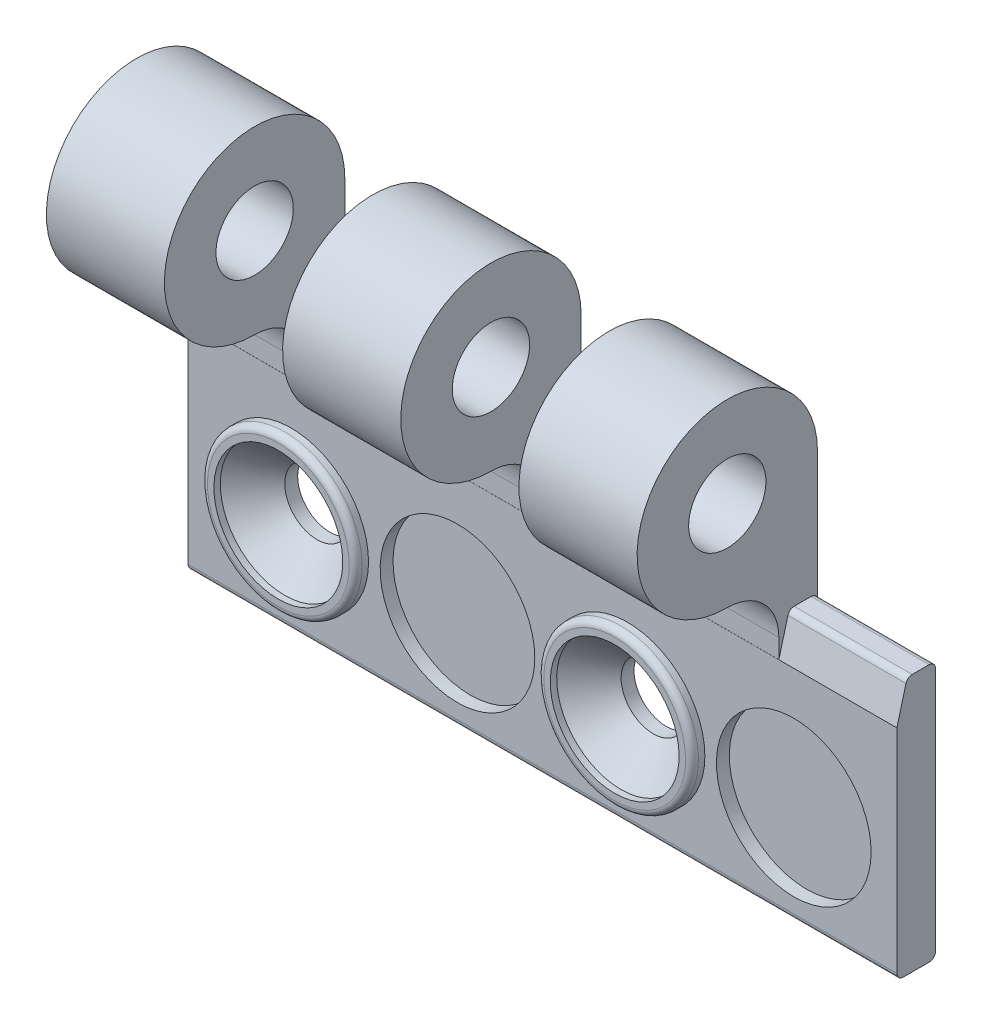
ISO-10303-21;
HEADER;
FILE_DESCRIPTION(('STEP AP214'),'2;1');
FILE_NAME('part.step','',(''),(''),'','','');
FILE_SCHEMA(('AUTOMOTIVE_DESIGN { 1 0 10303 214 1 1 1 1 }'));
ENDSEC;
DATA;
#1=APPLICATION_CONTEXT('core data for automotive mechanical design processes');
#2=APPLICATION_PROTOCOL_DEFINITION('international standard','automotive_design',2000,#1);
#3=PRODUCT_CONTEXT('',#1,'mechanical');
#4=PRODUCT('Part','Part','',(#3));
#5=PRODUCT_RELATED_PRODUCT_CATEGORY('part','',(#4));
#6=PRODUCT_DEFINITION_FORMATION('','',#4);
#7=PRODUCT_DEFINITION_CONTEXT('part definition',#1,'design');
#8=PRODUCT_DEFINITION('design','',#6,#7);
#9=PRODUCT_DEFINITION_SHAPE('','',#8);
#10=(LENGTH_UNIT() NAMED_UNIT(*) SI_UNIT(.MILLI.,.METRE.));
#11=(NAMED_UNIT(*) PLANE_ANGLE_UNIT() SI_UNIT($,.RADIAN.));
#12=(NAMED_UNIT(*) SI_UNIT($,.STERADIAN.) SOLID_ANGLE_UNIT());
#13=UNCERTAINTY_MEASURE_WITH_UNIT(LENGTH_MEASURE(1.E-05),#10,'distance_accuracy_value','');
#14=(GEOMETRIC_REPRESENTATION_CONTEXT(3) GLOBAL_UNCERTAINTY_ASSIGNED_CONTEXT((#13)) GLOBAL_UNIT_ASSIGNED_CONTEXT((#10,
#11,#12)) REPRESENTATION_CONTEXT('',''));
#15=CARTESIAN_POINT('',(0.,0.,0.));
#16=DIRECTION('',(0.,0.,1.));
#17=DIRECTION('',(1.,0.,0.));
#18=AXIS2_PLACEMENT_3D('',#15,#16,#17);
#19=CARTESIAN_POINT('',(-8.,11.85,0.49999999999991));
#20=DIRECTION('',(1.,0.,0.));
#21=DIRECTION('',(0.,1.,0.));
#22=AXIS2_PLACEMENT_3D('',#19,#20,#21);
#23=CYLINDRICAL_SURFACE('',#22,0.49999999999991);
#24=DIRECTION('',(1.,0.,0.));
#25=VECTOR('',#24,1.);
#26=CARTESIAN_POINT('',(-8.,11.8632012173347,0.000174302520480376));
#27=LINE('',#26,#25);
#28=CARTESIAN_POINT('',(1.16,11.8632012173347,0.000174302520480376));
#29=VERTEX_POINT('',#28);
#30=CARTESIAN_POINT('',(-8.,11.8632012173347,0.000174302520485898));
#31=VERTEX_POINT('',#30);
#32=EDGE_CURVE('E228',#29,#31,#27,.F.);
#33=ORIENTED_EDGE('',*,*,#32,.F.);
#34=CARTESIAN_POINT('',(1.16,11.85,0.49999999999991));
#35=DIRECTION('',(1.,0.,0.));
#36=DIRECTION('',(0.,1.,0.));
#37=AXIS2_PLACEMENT_3D('',#34,#35,#36);
#38=CIRCLE('',#37,0.49999999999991);
#39=CARTESIAN_POINT('',(1.16,12.35,0.5));
#40=VERTEX_POINT('',#39);
#41=EDGE_CURVE('E249',#40,#29,#38,.F.);
#42=ORIENTED_EDGE('',*,*,#41,.F.);
#43=DIRECTION('',(1.,0.,0.));
#44=VECTOR('',#43,1.);
#45=CARTESIAN_POINT('',(-8.,12.35,0.5));
#46=LINE('',#45,#44);
#47=CARTESIAN_POINT('',(10.33,12.35,0.5));
#48=VERTEX_POINT('',#47);
#49=EDGE_CURVE('E464',#40,#48,#46,.T.);
#50=ORIENTED_EDGE('',*,*,#49,.T.);
#51=CARTESIAN_POINT('',(10.33,11.85,0.49999999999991));
#52=DIRECTION('',(1.,0.,0.));
#53=DIRECTION('',(0.,1.,0.));
#54=AXIS2_PLACEMENT_3D('',#51,#52,#53);
#55=CIRCLE('',#54,0.49999999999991);
#56=CARTESIAN_POINT('',(10.33,11.8632012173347,0.000174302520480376));
#57=VERTEX_POINT('',#56);
#58=EDGE_CURVE('E359',#48,#57,#55,.F.);
#59=ORIENTED_EDGE('',*,*,#58,.T.);
#60=DIRECTION('',(1.,0.,0.));
#61=VECTOR('',#60,1.);
#62=CARTESIAN_POINT('',(-8.,11.8632012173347,0.000174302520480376));
#63=LINE('',#62,#61);
#64=CARTESIAN_POINT('',(19.5,11.8632012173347,0.000174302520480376));
#65=VERTEX_POINT('',#64);
#66=EDGE_CURVE('E494',#65,#57,#63,.F.);
#67=ORIENTED_EDGE('',*,*,#66,.F.);
#68=CARTESIAN_POINT('',(19.5,11.85,0.49999999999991));
#69=DIRECTION('',(1.,0.,0.));
#70=DIRECTION('',(0.,1.,0.));
#71=AXIS2_PLACEMENT_3D('',#68,#69,#70);
#72=CIRCLE('',#71,0.49999999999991);
#73=CARTESIAN_POINT('',(19.5,12.35,0.5));
#74=VERTEX_POINT('',#73);
#75=EDGE_CURVE('E350',#74,#65,#72,.F.);
#76=ORIENTED_EDGE('',*,*,#75,.F.);
#77=CARTESIAN_POINT('',(28.67,12.35,0.5));
#78=VERTEX_POINT('',#77);
#79=EDGE_CURVE('E467',#74,#78,#46,.T.);
#80=ORIENTED_EDGE('',*,*,#79,.T.);
#81=CARTESIAN_POINT('',(28.67,11.85,0.49999999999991));
#82=DIRECTION('',(1.,0.,0.));
#83=DIRECTION('',(0.,1.,0.));
#84=AXIS2_PLACEMENT_3D('',#81,#82,#83);
#85=CIRCLE('',#84,0.49999999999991);
#86=CARTESIAN_POINT('',(28.67,11.8632012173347,0.000174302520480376));
#87=VERTEX_POINT('',#86);
#88=EDGE_CURVE('E31',#78,#87,#85,.F.);
#89=ORIENTED_EDGE('',*,*,#88,.T.);
#90=DIRECTION('',(1.,0.,0.));
#91=VECTOR('',#90,1.);
#92=CARTESIAN_POINT('',(-8.,11.8632012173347,0.000174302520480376));
#93=LINE('',#92,#91);
#94=CARTESIAN_POINT('',(37.84,11.8632012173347,0.000174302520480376));
#95=VERTEX_POINT('',#94);
#96=EDGE_CURVE('E24',#95,#87,#93,.F.);
#97=ORIENTED_EDGE('',*,*,#96,.F.);
#98=CARTESIAN_POINT('',(37.84,11.85,0.49999999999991));
#99=DIRECTION('',(1.,0.,0.));
#100=DIRECTION('',(0.,1.,0.));
#101=AXIS2_PLACEMENT_3D('',#98,#99,#100);
#102=CIRCLE('',#101,0.49999999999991);
#103=CARTESIAN_POINT('',(37.84,12.35,0.5));
#104=VERTEX_POINT('',#103);
#105=EDGE_CURVE('E297',#104,#95,#102,.F.);
#106=ORIENTED_EDGE('',*,*,#105,.F.);
#107=CARTESIAN_POINT('',(47.,12.35,0.5));
#108=VERTEX_POINT('',#107);
#109=EDGE_CURVE('E462',#104,#108,#46,.T.);
#110=ORIENTED_EDGE('',*,*,#109,.T.);
#111=CARTESIAN_POINT('',(47.,11.85,0.49999999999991));
#112=DIRECTION('',(1.,0.,0.));
#113=DIRECTION('',(0.,-1.,0.));
#114=AXIS2_PLACEMENT_3D('',#111,#112,#113);
#115=CIRCLE('',#114,0.49999999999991);
#116=CARTESIAN_POINT('',(47.,11.85,0.));
#117=VERTEX_POINT('',#116);
#118=EDGE_CURVE('E410',#117,#108,#115,.T.);
#119=ORIENTED_EDGE('',*,*,#118,.F.);
#120=DIRECTION('',(1.,0.,0.));
#121=VECTOR('',#120,1.);
#122=CARTESIAN_POINT('',(-8.,11.85,0.));
#123=LINE('',#122,#121);
#124=CARTESIAN_POINT('',(-8.,11.85,0.));
#125=VERTEX_POINT('',#124);
#126=EDGE_CURVE('E466',#125,#117,#123,.T.);
#127=ORIENTED_EDGE('',*,*,#126,.F.);
#128=CARTESIAN_POINT('',(-8.,11.85,0.49999999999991));
#129=DIRECTION('',(1.,0.,0.));
#130=DIRECTION('',(0.,-1.,0.));
#131=AXIS2_PLACEMENT_3D('',#128,#129,#130);
#132=CIRCLE('',#131,0.49999999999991);
#133=EDGE_CURVE('E437',#125,#31,#132,.T.);
#134=ORIENTED_EDGE('',*,*,#133,.T.);
#135=EDGE_LOOP('',(#33,#42,#50,#59,#67,#76,#80,#89,#97,#106,#110,#119,#127,#134));
#136=FACE_BOUND('',#135,.T.);
#137=ADVANCED_FACE('F16',(#136),#23,.T.);
#138=CARTESIAN_POINT('',(-8.,11.9794095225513,2.2954518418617));
#139=DIRECTION('',(0.,0.258819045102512,0.965925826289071));
#140=DIRECTION('',(0.,-0.965925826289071,0.258819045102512));
#141=AXIS2_PLACEMENT_3D('',#138,#139,#140);
#142=PLANE('',#141);
#143=DIRECTION('',(1.,0.,0.));
#144=VECTOR('',#143,1.);
#145=CARTESIAN_POINT('',(-8.,9.35373205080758,2.999));
#146=LINE('',#145,#144);
#147=CARTESIAN_POINT('',(-8.,9.35373205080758,2.999));
#148=VERTEX_POINT('',#147);
#149=CARTESIAN_POINT('',(1.16,9.35373205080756,2.999));
#150=VERTEX_POINT('',#149);
#151=EDGE_CURVE('E236',#148,#150,#146,.T.);
#152=ORIENTED_EDGE('',*,*,#151,.F.);
#153=DIRECTION('',(0.,-0.965925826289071,0.258819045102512));
#154=VECTOR('',#153,1.);
#155=CARTESIAN_POINT('',(-8.,11.9794095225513,2.2954518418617));
#156=LINE('',#155,#154);
#157=CARTESIAN_POINT('',(-8.,9.35,3.));
#158=VERTEX_POINT('',#157);
#159=EDGE_CURVE('E439',#148,#158,#156,.T.);
#160=ORIENTED_EDGE('',*,*,#159,.T.);
#161=DIRECTION('',(1.,0.,0.));
#162=VECTOR('',#161,1.);
#163=CARTESIAN_POINT('',(-8.,9.35,3.));
#164=LINE('',#163,#162);
#165=CARTESIAN_POINT('',(47.,9.35,3.));
#166=VERTEX_POINT('',#165);
#167=EDGE_CURVE('E453',#158,#166,#164,.T.);
#168=ORIENTED_EDGE('',*,*,#167,.T.);
#169=DIRECTION('',(0.,-0.965925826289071,0.258819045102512));
#170=VECTOR('',#169,1.);
#171=CARTESIAN_POINT('',(47.,11.9794095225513,2.2954518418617));
#172=LINE('',#171,#170);
#173=CARTESIAN_POINT('',(47.,11.9794095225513,2.2954518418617));
#174=VERTEX_POINT('',#173);
#175=EDGE_CURVE('E419',#174,#166,#172,.T.);
#176=ORIENTED_EDGE('',*,*,#175,.F.);
#177=DIRECTION('',(1.,0.,0.));
#178=VECTOR('',#177,1.);
#179=CARTESIAN_POINT('',(-8.,11.9794095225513,2.2954518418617));
#180=LINE('',#179,#178);
#181=CARTESIAN_POINT('',(37.84,11.9794095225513,2.2954518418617));
#182=VERTEX_POINT('',#181);
#183=EDGE_CURVE('E455',#182,#174,#180,.T.);
#184=ORIENTED_EDGE('',*,*,#183,.F.);
#185=DIRECTION('',(0.,0.965925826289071,-0.258819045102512));
#186=VECTOR('',#185,1.);
#187=CARTESIAN_POINT('',(37.84,11.9794095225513,2.2954518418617));
#188=LINE('',#187,#186);
#189=CARTESIAN_POINT('',(37.84,9.35373205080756,2.999));
#190=VERTEX_POINT('',#189);
#191=EDGE_CURVE('E294',#190,#182,#188,.T.);
#192=ORIENTED_EDGE('',*,*,#191,.F.);
#193=DIRECTION('',(1.,0.,0.));
#194=VECTOR('',#193,1.);
#195=CARTESIAN_POINT('',(-8.,9.35373205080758,2.999));
#196=LINE('',#195,#194);
#197=CARTESIAN_POINT('',(28.67,9.35373205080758,2.999));
#198=VERTEX_POINT('',#197);
#199=EDGE_CURVE('E502',#198,#190,#196,.T.);
#200=ORIENTED_EDGE('',*,*,#199,.F.);
#201=DIRECTION('',(0.,0.965925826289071,-0.258819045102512));
#202=VECTOR('',#201,1.);
#203=CARTESIAN_POINT('',(28.67,11.9794095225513,2.2954518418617));
#204=LINE('',#203,#202);
#205=CARTESIAN_POINT('',(28.67,11.9794095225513,2.2954518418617));
#206=VERTEX_POINT('',#205);
#207=EDGE_CURVE('E301',#198,#206,#204,.T.);
#208=ORIENTED_EDGE('',*,*,#207,.T.);
#209=CARTESIAN_POINT('',(19.5,11.9794095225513,2.2954518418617));
#210=VERTEX_POINT('',#209);
#211=EDGE_CURVE('E459',#210,#206,#180,.T.);
#212=ORIENTED_EDGE('',*,*,#211,.F.);
#213=DIRECTION('',(0.,0.965925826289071,-0.258819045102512));
#214=VECTOR('',#213,1.);
#215=CARTESIAN_POINT('',(19.5,11.9794095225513,2.2954518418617));
#216=LINE('',#215,#214);
#217=CARTESIAN_POINT('',(19.5,9.35373205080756,2.999));
#218=VERTEX_POINT('',#217);
#219=EDGE_CURVE('E485',#218,#210,#216,.T.);
#220=ORIENTED_EDGE('',*,*,#219,.F.);
#221=DIRECTION('',(1.,0.,0.));
#222=VECTOR('',#221,1.);
#223=CARTESIAN_POINT('',(-8.,9.35373205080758,2.999));
#224=LINE('',#223,#222);
#225=CARTESIAN_POINT('',(10.33,9.35373205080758,2.999));
#226=VERTEX_POINT('',#225);
#227=EDGE_CURVE('E488',#226,#218,#224,.T.);
#228=ORIENTED_EDGE('',*,*,#227,.F.);
#229=DIRECTION('',(0.,0.965925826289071,-0.258819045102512));
#230=VECTOR('',#229,1.);
#231=CARTESIAN_POINT('',(10.33,11.9794095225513,2.2954518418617));
#232=LINE('',#231,#230);
#233=CARTESIAN_POINT('',(10.33,11.9794095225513,2.2954518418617));
#234=VERTEX_POINT('',#233);
#235=EDGE_CURVE('E491',#226,#234,#232,.T.);
#236=ORIENTED_EDGE('',*,*,#235,.T.);
#237=CARTESIAN_POINT('',(1.16,11.9794095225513,2.2954518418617));
#238=VERTEX_POINT('',#237);
#239=EDGE_CURVE('E456',#238,#234,#180,.T.);
#240=ORIENTED_EDGE('',*,*,#239,.F.);
#241=DIRECTION('',(0.,0.965925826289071,-0.258819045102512));
#242=VECTOR('',#241,1.);
#243=CARTESIAN_POINT('',(1.16,11.9794095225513,2.2954518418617));
#244=LINE('',#243,#242);
#245=EDGE_CURVE('E247',#150,#238,#244,.T.);
#246=ORIENTED_EDGE('',*,*,#245,.F.);
#247=EDGE_LOOP('',(#152,#160,#168,#176,#184,#192,#200,#208,#212,#220,#228,#236,#240,#246));
#248=FACE_BOUND('',#247,.T.);
#249=ADVANCED_FACE('F550',(#248),#142,.T.);
#250=CARTESIAN_POINT('',(-8.,12.35,0.5));
#251=DIRECTION('',(0.,1.,0.));
#252=DIRECTION('',(-1.,0.,0.));
#253=AXIS2_PLACEMENT_3D('',#250,#251,#252);
#254=PLANE('',#253);
#255=DIRECTION('',(1.,0.,0.));
#256=VECTOR('',#255,1.);
#257=CARTESIAN_POINT('',(-8.,12.35,1.8124889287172));
#258=LINE('',#257,#256);
#259=CARTESIAN_POINT('',(19.5,12.35,1.8124889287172));
#260=VERTEX_POINT('',#259);
#261=CARTESIAN_POINT('',(28.67,12.35,1.8124889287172));
#262=VERTEX_POINT('',#261);
#263=EDGE_CURVE('E463',#260,#262,#258,.T.);
#264=ORIENTED_EDGE('',*,*,#263,.T.);
#265=DIRECTION('',(0.,0.,-1.));
#266=VECTOR('',#265,1.);
#267=CARTESIAN_POINT('',(28.67,12.35,0.5));
#268=LINE('',#267,#266);
#269=EDGE_CURVE('E299',#262,#78,#268,.T.);
#270=ORIENTED_EDGE('',*,*,#269,.T.);
#271=ORIENTED_EDGE('',*,*,#79,.F.);
#272=DIRECTION('',(0.,0.,-1.));
#273=VECTOR('',#272,1.);
#274=CARTESIAN_POINT('',(19.5,12.35,0.5));
#275=LINE('',#274,#273);
#276=EDGE_CURVE('E347',#260,#74,#275,.T.);
#277=ORIENTED_EDGE('',*,*,#276,.F.);
#278=EDGE_LOOP('',(#264,#270,#271,#277));
#279=FACE_BOUND('',#278,.T.);
#280=ADVANCED_FACE('F531',(#279),#254,.T.);
#281=CARTESIAN_POINT('',(-8.,11.8499999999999,1.81248892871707));
#282=DIRECTION('',(1.,0.,0.));
#283=DIRECTION('',(0.,1.,0.));
#284=AXIS2_PLACEMENT_3D('',#281,#282,#283);
#285=CYLINDRICAL_SURFACE('',#284,0.500000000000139);
#286=ORIENTED_EDGE('',*,*,#211,.T.);
#287=CARTESIAN_POINT('',(28.67,11.8499999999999,1.81248892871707));
#288=DIRECTION('',(1.,0.,0.));
#289=DIRECTION('',(0.,1.,0.));
#290=AXIS2_PLACEMENT_3D('',#287,#288,#289);
#291=CIRCLE('',#290,0.500000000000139);
#292=EDGE_CURVE('E500',#206,#262,#291,.F.);
#293=ORIENTED_EDGE('',*,*,#292,.T.);
#294=ORIENTED_EDGE('',*,*,#263,.F.);
#295=CARTESIAN_POINT('',(19.5,11.8499999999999,1.81248892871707));
#296=DIRECTION('',(1.,0.,0.));
#297=DIRECTION('',(0.,1.,0.));
#298=AXIS2_PLACEMENT_3D('',#295,#296,#297);
#299=CIRCLE('',#298,0.500000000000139);
#300=EDGE_CURVE('E344',#210,#260,#299,.F.);
#301=ORIENTED_EDGE('',*,*,#300,.F.);
#302=EDGE_LOOP('',(#286,#293,#294,#301));
#303=FACE_BOUND('',#302,.T.);
#304=ADVANCED_FACE('F539',(#303),#285,.T.);
#305=DIRECTION('',(0.,0.,-1.));
#306=VECTOR('',#305,1.);
#307=CARTESIAN_POINT('',(1.16,12.35,0.5));
#308=LINE('',#307,#306);
#309=CARTESIAN_POINT('',(1.16,12.35,1.81248892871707));
#310=VERTEX_POINT('',#309);
#311=EDGE_CURVE('E245',#310,#40,#308,.T.);
#312=ORIENTED_EDGE('',*,*,#311,.F.);
#313=CARTESIAN_POINT('',(10.33,12.35,1.8124889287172));
#314=VERTEX_POINT('',#313);
#315=EDGE_CURVE('E460',#310,#314,#258,.T.);
#316=ORIENTED_EDGE('',*,*,#315,.T.);
#317=DIRECTION('',(0.,0.,-1.));
#318=VECTOR('',#317,1.);
#319=CARTESIAN_POINT('',(10.33,12.35,0.5));
#320=LINE('',#319,#318);
#321=EDGE_CURVE('E356',#314,#48,#320,.T.);
#322=ORIENTED_EDGE('',*,*,#321,.T.);
#323=ORIENTED_EDGE('',*,*,#49,.F.);
#324=EDGE_LOOP('',(#312,#316,#322,#323));
#325=FACE_BOUND('',#324,.T.);
#326=ADVANCED_FACE('F585',(#325),#254,.T.);
#327=CARTESIAN_POINT('',(1.16,11.8499999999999,1.81248892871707));
#328=DIRECTION('',(1.,0.,0.));
#329=DIRECTION('',(0.,1.,0.));
#330=AXIS2_PLACEMENT_3D('',#327,#328,#329);
#331=CIRCLE('',#330,0.500000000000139);
#332=EDGE_CURVE('E10',#238,#310,#331,.F.);
#333=ORIENTED_EDGE('',*,*,#332,.F.);
#334=ORIENTED_EDGE('',*,*,#239,.T.);
#335=CARTESIAN_POINT('',(10.33,11.8499999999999,1.81248892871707));
#336=DIRECTION('',(1.,0.,0.));
#337=DIRECTION('',(0.,1.,0.));
#338=AXIS2_PLACEMENT_3D('',#335,#336,#337);
#339=CIRCLE('',#338,0.500000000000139);
#340=EDGE_CURVE('E353',#234,#314,#339,.F.);
#341=ORIENTED_EDGE('',*,*,#340,.T.);
#342=ORIENTED_EDGE('',*,*,#315,.F.);
#343=EDGE_LOOP('',(#333,#334,#341,#342));
#344=FACE_BOUND('',#343,.T.);
#345=ADVANCED_FACE('F576',(#344),#285,.T.);
#346=CARTESIAN_POINT('',(-8.,-7.65,2.5));
#347=DIRECTION('',(0.,-1.,0.));
#348=DIRECTION('',(1.,0.,0.));
#349=AXIS2_PLACEMENT_3D('',#346,#347,#348);
#350=PLANE('',#349);
#351=DIRECTION('',(1.,0.,0.));
#352=VECTOR('',#351,1.);
#353=CARTESIAN_POINT('',(-8.,-7.65,0.5));
#354=LINE('',#353,#352);
#355=CARTESIAN_POINT('',(-8.,-7.65,0.5));
#356=VERTEX_POINT('',#355);
#357=CARTESIAN_POINT('',(47.,-7.65,0.5));
#358=VERTEX_POINT('',#357);
#359=EDGE_CURVE('E471',#356,#358,#354,.T.);
#360=ORIENTED_EDGE('',*,*,#359,.T.);
#361=DIRECTION('',(0.,0.,-1.));
#362=VECTOR('',#361,1.);
#363=CARTESIAN_POINT('',(47.,-7.65,2.5));
#364=LINE('',#363,#362);
#365=CARTESIAN_POINT('',(47.,-7.65,2.5));
#366=VERTEX_POINT('',#365);
#367=EDGE_CURVE('E403',#366,#358,#364,.T.);
#368=ORIENTED_EDGE('',*,*,#367,.F.);
#369=DIRECTION('',(1.,0.,0.));
#370=VECTOR('',#369,1.);
#371=CARTESIAN_POINT('',(-8.,-7.65,2.5));
#372=LINE('',#371,#370);
#373=CARTESIAN_POINT('',(-8.,-7.65,2.5));
#374=VERTEX_POINT('',#373);
#375=EDGE_CURVE('E447',#374,#366,#372,.T.);
#376=ORIENTED_EDGE('',*,*,#375,.F.);
#377=DIRECTION('',(0.,0.,-1.));
#378=VECTOR('',#377,1.);
#379=CARTESIAN_POINT('',(-8.,-7.65,2.5));
#380=LINE('',#379,#378);
#381=EDGE_CURVE('E428',#374,#356,#380,.T.);
#382=ORIENTED_EDGE('',*,*,#381,.T.);
#383=EDGE_LOOP('',(#360,#368,#376,#382));
#384=FACE_BOUND('',#383,.T.);
#385=ADVANCED_FACE('F18',(#384),#350,.T.);
#386=CARTESIAN_POINT('',(-8.,-7.1499999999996,0.50000000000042));
#387=DIRECTION('',(1.,0.,0.));
#388=DIRECTION('',(0.,1.,0.));
#389=AXIS2_PLACEMENT_3D('',#386,#387,#388);
#390=CYLINDRICAL_SURFACE('',#389,0.500000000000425);
#391=DIRECTION('',(1.,0.,0.));
#392=VECTOR('',#391,1.);
#393=CARTESIAN_POINT('',(-8.,-7.15,0.));
#394=LINE('',#393,#392);
#395=CARTESIAN_POINT('',(-8.,-7.15,0.));
#396=VERTEX_POINT('',#395);
#397=CARTESIAN_POINT('',(47.,-7.15,0.));
#398=VERTEX_POINT('',#397);
#399=EDGE_CURVE('E469',#396,#398,#394,.T.);
#400=ORIENTED_EDGE('',*,*,#399,.T.);
#401=CARTESIAN_POINT('',(47.,-7.1499999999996,0.50000000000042));
#402=DIRECTION('',(1.,0.,0.));
#403=DIRECTION('',(0.,1.,0.));
#404=AXIS2_PLACEMENT_3D('',#401,#402,#403);
#405=CIRCLE('',#404,0.500000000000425);
#406=EDGE_CURVE('E404',#358,#398,#405,.T.);
#407=ORIENTED_EDGE('',*,*,#406,.F.);
#408=ORIENTED_EDGE('',*,*,#359,.F.);
#409=CARTESIAN_POINT('',(-8.,-7.1499999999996,0.50000000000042));
#410=DIRECTION('',(1.,0.,0.));
#411=DIRECTION('',(0.,1.,0.));
#412=AXIS2_PLACEMENT_3D('',#409,#410,#411);
#413=CIRCLE('',#412,0.500000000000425);
#414=EDGE_CURVE('E431',#356,#396,#413,.T.);
#415=ORIENTED_EDGE('',*,*,#414,.T.);
#416=EDGE_LOOP('',(#400,#407,#408,#415));
#417=FACE_BOUND('',#416,.T.);
#418=ADVANCED_FACE('F635',(#417),#390,.T.);
#419=CARTESIAN_POINT('',(-8.,-7.15,0.));
#420=DIRECTION('',(0.,0.,-1.));
#421=DIRECTION('',(-1.,0.,0.));
#422=AXIS2_PLACEMENT_3D('',#419,#420,#421);
#423=PLANE('',#422);
#424=CARTESIAN_POINT('',(26.1,0.,0.));
#425=DIRECTION('',(0.,0.,1.));
#426=DIRECTION('',(0.,-1.,0.));
#427=AXIS2_PLACEMENT_3D('',#424,#425,#426);
#428=CIRCLE('',#427,2.5);
#429=CARTESIAN_POINT('',(26.1,-2.5,0.));
#430=VERTEX_POINT('',#429);
#431=EDGE_CURVE('E361',#430,#430,#428,.T.);
#432=ORIENTED_EDGE('',*,*,#431,.T.);
#433=EDGE_LOOP('',(#432));
#434=FACE_BOUND('',#433,.T.);
#435=CARTESIAN_POINT('',(0.,0.,0.));
#436=DIRECTION('',(0.,0.,1.));
#437=DIRECTION('',(0.,-1.,0.));
#438=AXIS2_PLACEMENT_3D('',#435,#436,#437);
#439=CIRCLE('',#438,2.5);
#440=CARTESIAN_POINT('',(0.,-2.5,0.));
#441=VERTEX_POINT('',#440);
#442=EDGE_CURVE('E372',#441,#441,#439,.T.);
#443=ORIENTED_EDGE('',*,*,#442,.T.);
#444=EDGE_LOOP('',(#443));
#445=FACE_BOUND('',#444,.T.);
#446=ORIENTED_EDGE('',*,*,#126,.T.);
#447=DIRECTION('',(0.,1.,0.));
#448=VECTOR('',#447,1.);
#449=CARTESIAN_POINT('',(47.,-7.15,0.));
#450=LINE('',#449,#448);
#451=EDGE_CURVE('E407',#398,#117,#450,.T.);
#452=ORIENTED_EDGE('',*,*,#451,.F.);
#453=ORIENTED_EDGE('',*,*,#399,.F.);
#454=DIRECTION('',(0.,1.,0.));
#455=VECTOR('',#454,1.);
#456=CARTESIAN_POINT('',(-8.,-7.15,0.));
#457=LINE('',#456,#455);
#458=EDGE_CURVE('E434',#396,#125,#457,.T.);
#459=ORIENTED_EDGE('',*,*,#458,.T.);
#460=EDGE_LOOP('',(#446,#452,#453,#459));
#461=FACE_BOUND('',#460,.T.);
#462=ADVANCED_FACE('F632',(#434,#445,#461),#423,.T.);
#463=DIRECTION('',(0.,0.,-1.));
#464=VECTOR('',#463,1.);
#465=CARTESIAN_POINT('',(37.84,12.35,0.5));
#466=LINE('',#465,#464);
#467=CARTESIAN_POINT('',(37.84,12.35,1.81248892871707));
#468=VERTEX_POINT('',#467);
#469=EDGE_CURVE('E291',#468,#104,#466,.T.);
#470=ORIENTED_EDGE('',*,*,#469,.F.);
#471=CARTESIAN_POINT('',(47.,12.35,1.8124889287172));
#472=VERTEX_POINT('',#471);
#473=EDGE_CURVE('E458',#468,#472,#258,.T.);
#474=ORIENTED_EDGE('',*,*,#473,.T.);
#475=DIRECTION('',(0.,0.,1.));
#476=VECTOR('',#475,1.);
#477=CARTESIAN_POINT('',(47.,12.35,0.5));
#478=LINE('',#477,#476);
#479=EDGE_CURVE('E413',#108,#472,#478,.T.);
#480=ORIENTED_EDGE('',*,*,#479,.F.);
#481=ORIENTED_EDGE('',*,*,#109,.F.);
#482=EDGE_LOOP('',(#470,#474,#480,#481));
#483=FACE_BOUND('',#482,.T.);
#484=ADVANCED_FACE('F527',(#483),#254,.T.);
#485=CARTESIAN_POINT('',(37.84,11.8499999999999,1.81248892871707));
#486=DIRECTION('',(1.,0.,0.));
#487=DIRECTION('',(0.,1.,0.));
#488=AXIS2_PLACEMENT_3D('',#485,#486,#487);
#489=CIRCLE('',#488,0.500000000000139);
#490=EDGE_CURVE('E497',#182,#468,#489,.F.);
#491=ORIENTED_EDGE('',*,*,#490,.F.);
#492=ORIENTED_EDGE('',*,*,#183,.T.);
#493=CARTESIAN_POINT('',(47.,11.8499999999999,1.81248892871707));
#494=DIRECTION('',(1.,0.,0.));
#495=DIRECTION('',(0.,1.,0.));
#496=AXIS2_PLACEMENT_3D('',#493,#494,#495);
#497=CIRCLE('',#496,0.500000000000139);
#498=EDGE_CURVE('E416',#472,#174,#497,.T.);
#499=ORIENTED_EDGE('',*,*,#498,.F.);
#500=ORIENTED_EDGE('',*,*,#473,.F.);
#501=EDGE_LOOP('',(#491,#492,#499,#500));
#502=FACE_BOUND('',#501,.T.);
#503=ADVANCED_FACE('F546',(#502),#285,.T.);
#504=CARTESIAN_POINT('',(-8.,9.35,3.));
#505=DIRECTION('',(0.,0.,1.));
#506=DIRECTION('',(1.,0.,0.));
#507=AXIS2_PLACEMENT_3D('',#504,#505,#506);
#508=PLANE('',#507);
#509=CARTESIAN_POINT('',(12.9,0.,3.));
#510=DIRECTION('',(0.,0.,1.));
#511=DIRECTION('',(1.,0.,0.));
#512=AXIS2_PLACEMENT_3D('',#509,#510,#511);
#513=CIRCLE('',#512,6.);
#514=CARTESIAN_POINT('',(18.9,0.,3.));
#515=VERTEX_POINT('',#514);
#516=EDGE_CURVE('E482',#515,#515,#513,.T.);
#517=ORIENTED_EDGE('',*,*,#516,.F.);
#518=EDGE_LOOP('',(#517));
#519=FACE_BOUND('',#518,.T.);
#520=CARTESIAN_POINT('',(39.,0.,3.));
#521=DIRECTION('',(0.,0.,1.));
#522=DIRECTION('',(1.,0.,0.));
#523=AXIS2_PLACEMENT_3D('',#520,#521,#522);
#524=CIRCLE('',#523,6.);
#525=CARTESIAN_POINT('',(45.,0.,3.));
#526=VERTEX_POINT('',#525);
#527=EDGE_CURVE('E479',#526,#526,#524,.T.);
#528=ORIENTED_EDGE('',*,*,#527,.F.);
#529=EDGE_LOOP('',(#528));
#530=FACE_BOUND('',#529,.T.);
#531=CARTESIAN_POINT('',(26.1,0.,3.));
#532=DIRECTION('',(0.,0.,1.));
#533=DIRECTION('',(1.,0.,0.));
#534=AXIS2_PLACEMENT_3D('',#531,#532,#533);
#535=CIRCLE('',#534,6.);
#536=CARTESIAN_POINT('',(32.1,0.,3.));
#537=VERTEX_POINT('',#536);
#538=EDGE_CURVE('E476',#537,#537,#535,.T.);
#539=ORIENTED_EDGE('',*,*,#538,.F.);
#540=EDGE_LOOP('',(#539));
#541=FACE_BOUND('',#540,.T.);
#542=CARTESIAN_POINT('',(0.,0.,3.));
#543=DIRECTION('',(0.,0.,1.));
#544=DIRECTION('',(1.,0.,0.));
#545=AXIS2_PLACEMENT_3D('',#542,#543,#544);
#546=CIRCLE('',#545,6.);
#547=CARTESIAN_POINT('',(6.,0.,3.));
#548=VERTEX_POINT('',#547);
#549=EDGE_CURVE('E473',#548,#548,#546,.T.);
#550=ORIENTED_EDGE('',*,*,#549,.F.);
#551=EDGE_LOOP('',(#550));
#552=FACE_BOUND('',#551,.T.);
#553=DIRECTION('',(1.,0.,0.));
#554=VECTOR('',#553,1.);
#555=CARTESIAN_POINT('',(-8.,-7.15,3.));
#556=LINE('',#555,#554);
#557=CARTESIAN_POINT('',(-8.,-7.15,3.));
#558=VERTEX_POINT('',#557);
#559=CARTESIAN_POINT('',(47.,-7.15,3.));
#560=VERTEX_POINT('',#559);
#561=EDGE_CURVE('E451',#558,#560,#556,.T.);
#562=ORIENTED_EDGE('',*,*,#561,.T.);
#563=DIRECTION('',(0.,-1.,0.));
#564=VECTOR('',#563,1.);
#565=CARTESIAN_POINT('',(47.,9.35,3.));
#566=LINE('',#565,#564);
#567=EDGE_CURVE('E422',#166,#560,#566,.T.);
#568=ORIENTED_EDGE('',*,*,#567,.F.);
#569=ORIENTED_EDGE('',*,*,#167,.F.);
#570=DIRECTION('',(0.,-1.,0.));
#571=VECTOR('',#570,1.);
#572=CARTESIAN_POINT('',(-8.,9.35,3.));
#573=LINE('',#572,#571);
#574=EDGE_CURVE('E441',#158,#558,#573,.T.);
#575=ORIENTED_EDGE('',*,*,#574,.T.);
#576=EDGE_LOOP('',(#562,#568,#569,#575));
#577=FACE_BOUND('',#576,.T.);
#578=ADVANCED_FACE('F621',(#519,#530,#541,#552,#577),#508,.T.);
#579=CARTESIAN_POINT('',(-8.,-7.1499999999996,2.49999999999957));
#580=DIRECTION('',(1.,0.,0.));
#581=DIRECTION('',(0.,1.,0.));
#582=AXIS2_PLACEMENT_3D('',#579,#580,#581);
#583=CYLINDRICAL_SURFACE('',#582,0.500000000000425);
#584=ORIENTED_EDGE('',*,*,#375,.T.);
#585=CARTESIAN_POINT('',(47.,-7.1499999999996,2.49999999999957));
#586=DIRECTION('',(1.,0.,0.));
#587=DIRECTION('',(0.,1.,0.));
#588=AXIS2_PLACEMENT_3D('',#585,#586,#587);
#589=CIRCLE('',#588,0.500000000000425);
#590=EDGE_CURVE('E425',#560,#366,#589,.T.);
#591=ORIENTED_EDGE('',*,*,#590,.F.);
#592=ORIENTED_EDGE('',*,*,#561,.F.);
#593=CARTESIAN_POINT('',(-8.,-7.1499999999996,2.49999999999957));
#594=DIRECTION('',(1.,0.,0.));
#595=DIRECTION('',(0.,1.,0.));
#596=AXIS2_PLACEMENT_3D('',#593,#594,#595);
#597=CIRCLE('',#596,0.500000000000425);
#598=EDGE_CURVE('E444',#558,#374,#597,.T.);
#599=ORIENTED_EDGE('',*,*,#598,.T.);
#600=EDGE_LOOP('',(#584,#591,#592,#599));
#601=FACE_BOUND('',#600,.T.);
#602=ADVANCED_FACE('F626',(#601),#583,.T.);
#603=CARTESIAN_POINT('',(-8.,-7.1499999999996,0.50000000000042));
#604=DIRECTION('',(1.,0.,0.));
#605=DIRECTION('',(0.,1.,0.));
#606=AXIS2_PLACEMENT_3D('',#603,#604,#605);
#607=PLANE('',#606);
#608=DIRECTION('',(0.,-0.999999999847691,1.7453292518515E-05));
#609=VECTOR('',#608,1.);
#610=CARTESIAN_POINT('',(-8.,21.8498778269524,2.1323038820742E-09));
#611=LINE('',#610,#609);
#612=CARTESIAN_POINT('',(-8.,21.8498778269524,2.13230735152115E-09));
#613=VERTEX_POINT('',#612);
#614=EDGE_CURVE('E214',#613,#31,#611,.T.);
#615=ORIENTED_EDGE('',*,*,#614,.T.);
#616=ORIENTED_EDGE('',*,*,#133,.F.);
#617=ORIENTED_EDGE('',*,*,#458,.F.);
#618=ORIENTED_EDGE('',*,*,#414,.F.);
#619=ORIENTED_EDGE('',*,*,#381,.F.);
#620=ORIENTED_EDGE('',*,*,#598,.F.);
#621=ORIENTED_EDGE('',*,*,#574,.F.);
#622=ORIENTED_EDGE('',*,*,#159,.F.);
#623=DIRECTION('',(0.,1.,0.));
#624=VECTOR('',#623,1.);
#625=CARTESIAN_POINT('',(-8.,6.85,2.999));
#626=LINE('',#625,#624);
#627=CARTESIAN_POINT('',(-8.,10.850000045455,2.999));
#628=VERTEX_POINT('',#627);
#629=EDGE_CURVE('E614',#148,#628,#626,.T.);
#630=ORIENTED_EDGE('',*,*,#629,.T.);
#631=CARTESIAN_POINT('',(-8.,10.8500000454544,6.99900000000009));
#632=DIRECTION('',(1.,0.,0.));
#633=DIRECTION('',(0.,0.,-1.));
#634=AXIS2_PLACEMENT_3D('',#631,#632,#633);
#635=CIRCLE('',#634,4.00000000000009);
#636=CARTESIAN_POINT('',(-8.,14.8500000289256,6.99936363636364));
#637=VERTEX_POINT('',#636);
#638=EDGE_CURVE('E217',#628,#637,#635,.T.);
#639=ORIENTED_EDGE('',*,*,#638,.T.);
#640=CARTESIAN_POINT('',(-8.,21.8499999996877,7.00000000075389));
#641=DIRECTION('',(1.,0.,0.));
#642=DIRECTION('',(0.,0.,-1.));
#643=AXIS2_PLACEMENT_3D('',#640,#641,#642);
#644=CIRCLE('',#643,6.99999999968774);
#645=EDGE_CURVE('E209',#637,#613,#644,.F.);
#646=ORIENTED_EDGE('',*,*,#645,.T.);
#647=EDGE_LOOP('',(#615,#616,#617,#618,#619,#620,#621,#622,#630,#639,#646));
#648=FACE_BOUND('',#647,.T.);
#649=CARTESIAN_POINT('',(-8.,21.85,7.));
#650=DIRECTION('',(1.,0.,0.));
#651=DIRECTION('',(0.,0.,-1.));
#652=AXIS2_PLACEMENT_3D('',#649,#650,#651);
#653=CIRCLE('',#652,3.);
#654=CARTESIAN_POINT('',(-8.,21.85,4.));
#655=VERTEX_POINT('',#654);
#656=EDGE_CURVE('E230',#655,#655,#653,.F.);
#657=ORIENTED_EDGE('',*,*,#656,.F.);
#658=EDGE_LOOP('',(#657));
#659=FACE_BOUND('',#658,.T.);
#660=ADVANCED_FACE('F211',(#648,#659),#607,.F.);
#661=CARTESIAN_POINT('',(47.,-7.1499999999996,0.50000000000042));
#662=DIRECTION('',(1.,0.,0.));
#663=DIRECTION('',(0.,1.,0.));
#664=AXIS2_PLACEMENT_3D('',#661,#662,#663);
#665=PLANE('',#664);
#666=ORIENTED_EDGE('',*,*,#367,.T.);
#667=ORIENTED_EDGE('',*,*,#406,.T.);
#668=ORIENTED_EDGE('',*,*,#451,.T.);
#669=ORIENTED_EDGE('',*,*,#118,.T.);
#670=ORIENTED_EDGE('',*,*,#479,.T.);
#671=ORIENTED_EDGE('',*,*,#498,.T.);
#672=ORIENTED_EDGE('',*,*,#175,.T.);
#673=ORIENTED_EDGE('',*,*,#567,.T.);
#674=ORIENTED_EDGE('',*,*,#590,.T.);
#675=EDGE_LOOP('',(#666,#667,#668,#669,#670,#671,#672,#673,#674));
#676=FACE_BOUND('',#675,.T.);
#677=ADVANCED_FACE('F544',(#676),#665,.T.);
#678=CARTESIAN_POINT('',(0.,0.,4.));
#679=DIRECTION('',(0.,0.,1.));
#680=DIRECTION('',(0.,-1.,0.));
#681=AXIS2_PLACEMENT_3D('',#678,#679,#680);
#682=PLANE('',#681);
#683=CARTESIAN_POINT('',(0.,0.,4.));
#684=DIRECTION('',(0.,0.,1.));
#685=DIRECTION('',(0.,-1.,0.));
#686=AXIS2_PLACEMENT_3D('',#683,#684,#685);
#687=CIRCLE('',#686,5.);
#688=CARTESIAN_POINT('',(0.,-5.,4.));
#689=VERTEX_POINT('',#688);
#690=EDGE_CURVE('E382',#689,#689,#687,.T.);
#691=ORIENTED_EDGE('',*,*,#690,.F.);
#692=EDGE_LOOP('',(#691));
#693=FACE_BOUND('',#692,.T.);
#694=CARTESIAN_POINT('',(0.,0.,4.));
#695=DIRECTION('',(0.,0.,1.));
#696=DIRECTION('',(0.,-1.,0.));
#697=AXIS2_PLACEMENT_3D('',#694,#695,#696);
#698=CIRCLE('',#697,5.5);
#699=CARTESIAN_POINT('',(0.,-5.5,4.));
#700=VERTEX_POINT('',#699);
#701=EDGE_CURVE('E400',#700,#700,#698,.T.);
#702=ORIENTED_EDGE('',*,*,#701,.T.);
#703=EDGE_LOOP('',(#702));
#704=FACE_BOUND('',#703,.T.);
#705=ADVANCED_FACE('F666',(#693,#704),#682,.T.);
#706=CARTESIAN_POINT('',(0.,0.,3.49999999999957));
#707=DIRECTION('',(0.,0.,1.));
#708=DIRECTION('',(0.,-1.,0.));
#709=AXIS2_PLACEMENT_3D('',#706,#707,#708);
#710=TOROIDAL_SURFACE('',#709,5.49999999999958,0.500000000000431);
#711=CARTESIAN_POINT('',(0.,0.,3.5));
#712=DIRECTION('',(0.,0.,1.));
#713=DIRECTION('',(0.,-1.,0.));
#714=AXIS2_PLACEMENT_3D('',#711,#712,#713);
#715=CIRCLE('',#714,6.);
#716=CARTESIAN_POINT('',(0.,-6.,3.5));
#717=VERTEX_POINT('',#716);
#718=EDGE_CURVE('E397',#717,#717,#715,.T.);
#719=ORIENTED_EDGE('',*,*,#718,.T.);
#720=EDGE_LOOP('',(#719));
#721=FACE_BOUND('',#720,.T.);
#722=ORIENTED_EDGE('',*,*,#701,.F.);
#723=EDGE_LOOP('',(#722));
#724=FACE_BOUND('',#723,.T.);
#725=ADVANCED_FACE('F669',(#721,#724),#710,.T.);
#726=CARTESIAN_POINT('',(0.,0.,1.5));
#727=DIRECTION('',(0.,0.,1.));
#728=DIRECTION('',(0.,-1.,0.));
#729=AXIS2_PLACEMENT_3D('',#726,#727,#728);
#730=CYLINDRICAL_SURFACE('',#729,6.);
#731=ORIENTED_EDGE('',*,*,#549,.T.);
#732=EDGE_LOOP('',(#731));
#733=FACE_BOUND('',#732,.T.);
#734=ORIENTED_EDGE('',*,*,#718,.F.);
#735=EDGE_LOOP('',(#734));
#736=FACE_BOUND('',#735,.T.);
#737=ADVANCED_FACE('F673',(#733,#736),#730,.T.);
#738=CARTESIAN_POINT('',(26.1,0.,4.));
#739=DIRECTION('',(0.,0.,1.));
#740=DIRECTION('',(0.,-1.,0.));
#741=AXIS2_PLACEMENT_3D('',#738,#739,#740);
#742=PLANE('',#741);
#743=CARTESIAN_POINT('',(26.1,0.,4.));
#744=DIRECTION('',(0.,0.,1.));
#745=DIRECTION('',(0.,-1.,0.));
#746=AXIS2_PLACEMENT_3D('',#743,#744,#745);
#747=CIRCLE('',#746,5.);
#748=CARTESIAN_POINT('',(26.1,-5.,4.));
#749=VERTEX_POINT('',#748);
#750=EDGE_CURVE('E370',#749,#749,#747,.T.);
#751=ORIENTED_EDGE('',*,*,#750,.F.);
#752=EDGE_LOOP('',(#751));
#753=FACE_BOUND('',#752,.T.);
#754=CARTESIAN_POINT('',(26.1,0.,4.));
#755=DIRECTION('',(0.,0.,1.));
#756=DIRECTION('',(0.,-1.,0.));
#757=AXIS2_PLACEMENT_3D('',#754,#755,#756);
#758=CIRCLE('',#757,5.5);
#759=CARTESIAN_POINT('',(26.1,-5.5,4.));
#760=VERTEX_POINT('',#759);
#761=EDGE_CURVE('E394',#760,#760,#758,.T.);
#762=ORIENTED_EDGE('',*,*,#761,.T.);
#763=EDGE_LOOP('',(#762));
#764=FACE_BOUND('',#763,.T.);
#765=ADVANCED_FACE('F677',(#753,#764),#742,.T.);
#766=CARTESIAN_POINT('',(26.1,0.,3.5));
#767=DIRECTION('',(0.,0.,1.));
#768=DIRECTION('',(0.,-1.,0.));
#769=AXIS2_PLACEMENT_3D('',#766,#767,#768);
#770=TOROIDAL_SURFACE('',#769,5.5,0.499999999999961);
#771=CARTESIAN_POINT('',(26.1,0.,3.5));
#772=DIRECTION('',(0.,0.,1.));
#773=DIRECTION('',(0.,-1.,0.));
#774=AXIS2_PLACEMENT_3D('',#771,#772,#773);
#775=CIRCLE('',#774,6.);
#776=CARTESIAN_POINT('',(26.1,-6.,3.5));
#777=VERTEX_POINT('',#776);
#778=EDGE_CURVE('E391',#777,#777,#775,.T.);
#779=ORIENTED_EDGE('',*,*,#778,.T.);
#780=EDGE_LOOP('',(#779));
#781=FACE_BOUND('',#780,.T.);
#782=ORIENTED_EDGE('',*,*,#761,.F.);
#783=EDGE_LOOP('',(#782));
#784=FACE_BOUND('',#783,.T.);
#785=ADVANCED_FACE('F681',(#781,#784),#770,.T.);
#786=CARTESIAN_POINT('',(26.1,0.,1.5));
#787=DIRECTION('',(0.,0.,1.));
#788=DIRECTION('',(0.,-1.,0.));
#789=AXIS2_PLACEMENT_3D('',#786,#787,#788);
#790=CYLINDRICAL_SURFACE('',#789,6.);
#791=ORIENTED_EDGE('',*,*,#538,.T.);
#792=EDGE_LOOP('',(#791));
#793=FACE_BOUND('',#792,.T.);
#794=ORIENTED_EDGE('',*,*,#778,.F.);
#795=EDGE_LOOP('',(#794));
#796=FACE_BOUND('',#795,.T.);
#797=ADVANCED_FACE('F685',(#793,#796),#790,.T.);
#798=CARTESIAN_POINT('',(39.,0.,2.));
#799=DIRECTION('',(0.,0.,1.));
#800=DIRECTION('',(0.,-1.,0.));
#801=AXIS2_PLACEMENT_3D('',#798,#799,#800);
#802=CYLINDRICAL_SURFACE('',#801,6.);
#803=CARTESIAN_POINT('',(39.,0.,2.));
#804=DIRECTION('',(0.,0.,1.));
#805=DIRECTION('',(0.,-1.,0.));
#806=AXIS2_PLACEMENT_3D('',#803,#804,#805);
#807=CIRCLE('',#806,6.);
#808=CARTESIAN_POINT('',(39.,-6.,2.));
#809=VERTEX_POINT('',#808);
#810=EDGE_CURVE('E388',#809,#809,#807,.T.);
#811=ORIENTED_EDGE('',*,*,#810,.F.);
#812=EDGE_LOOP('',(#811));
#813=FACE_BOUND('',#812,.T.);
#814=ORIENTED_EDGE('',*,*,#527,.T.);
#815=EDGE_LOOP('',(#814));
#816=FACE_BOUND('',#815,.T.);
#817=ADVANCED_FACE('F689',(#813,#816),#802,.F.);
#818=CARTESIAN_POINT('',(33.,0.,2.));
#819=DIRECTION('',(0.,0.,-1.));
#820=DIRECTION('',(0.,1.,0.));
#821=AXIS2_PLACEMENT_3D('',#818,#819,#820);
#822=PLANE('',#821);
#823=ORIENTED_EDGE('',*,*,#810,.T.);
#824=EDGE_LOOP('',(#823));
#825=FACE_BOUND('',#824,.T.);
#826=ADVANCED_FACE('F693',(#825),#822,.F.);
#827=CARTESIAN_POINT('',(12.9,0.,2.));
#828=DIRECTION('',(0.,0.,1.));
#829=DIRECTION('',(0.,-1.,0.));
#830=AXIS2_PLACEMENT_3D('',#827,#828,#829);
#831=CYLINDRICAL_SURFACE('',#830,6.);
#832=CARTESIAN_POINT('',(12.9,0.,2.));
#833=DIRECTION('',(0.,0.,1.));
#834=DIRECTION('',(0.,-1.,0.));
#835=AXIS2_PLACEMENT_3D('',#832,#833,#834);
#836=CIRCLE('',#835,6.);
#837=CARTESIAN_POINT('',(12.9,-6.,2.));
#838=VERTEX_POINT('',#837);
#839=EDGE_CURVE('E385',#838,#838,#836,.T.);
#840=ORIENTED_EDGE('',*,*,#839,.F.);
#841=EDGE_LOOP('',(#840));
#842=FACE_BOUND('',#841,.T.);
#843=ORIENTED_EDGE('',*,*,#516,.T.);
#844=EDGE_LOOP('',(#843));
#845=FACE_BOUND('',#844,.T.);
#846=ADVANCED_FACE('F697',(#842,#845),#831,.F.);
#847=CARTESIAN_POINT('',(6.9,0.,2.));
#848=DIRECTION('',(0.,0.,-1.));
#849=DIRECTION('',(0.,1.,0.));
#850=AXIS2_PLACEMENT_3D('',#847,#848,#849);
#851=PLANE('',#850);
#852=ORIENTED_EDGE('',*,*,#839,.T.);
#853=EDGE_LOOP('',(#852));
#854=FACE_BOUND('',#853,.T.);
#855=ADVANCED_FACE('F701',(#854),#851,.F.);
#856=CARTESIAN_POINT('',(0.,0.,0.));
#857=DIRECTION('',(0.,0.,1.));
#858=DIRECTION('',(0.,-1.,0.));
#859=AXIS2_PLACEMENT_3D('',#856,#857,#858);
#860=CYLINDRICAL_SURFACE('',#859,5.);
#861=CARTESIAN_POINT('',(0.,0.,3.5));
#862=DIRECTION('',(0.,0.,1.));
#863=DIRECTION('',(0.,-1.,0.));
#864=AXIS2_PLACEMENT_3D('',#861,#862,#863);
#865=CIRCLE('',#864,5.);
#866=CARTESIAN_POINT('',(0.,-5.,3.5));
#867=VERTEX_POINT('',#866);
#868=EDGE_CURVE('E379',#867,#867,#865,.T.);
#869=ORIENTED_EDGE('',*,*,#868,.F.);
#870=EDGE_LOOP('',(#869));
#871=FACE_BOUND('',#870,.T.);
#872=ORIENTED_EDGE('',*,*,#690,.T.);
#873=EDGE_LOOP('',(#872));
#874=FACE_BOUND('',#873,.T.);
#875=ADVANCED_FACE('F705',(#871,#874),#860,.F.);
#876=CARTESIAN_POINT('',(0.,0.,3.5));
#877=DIRECTION('',(0.,0.,1.));
#878=DIRECTION('',(0.,-1.,0.));
#879=AXIS2_PLACEMENT_3D('',#876,#877,#878);
#880=CONICAL_SURFACE('',#879,5.,0.785398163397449);
#881=CARTESIAN_POINT('',(0.,0.,1.));
#882=DIRECTION('',(0.,0.,1.));
#883=DIRECTION('',(0.,-1.,0.));
#884=AXIS2_PLACEMENT_3D('',#881,#882,#883);
#885=CIRCLE('',#884,2.5);
#886=CARTESIAN_POINT('',(0.,-2.5,1.));
#887=VERTEX_POINT('',#886);
#888=EDGE_CURVE('E376',#887,#887,#885,.T.);
#889=ORIENTED_EDGE('',*,*,#888,.F.);
#890=EDGE_LOOP('',(#889));
#891=FACE_BOUND('',#890,.T.);
#892=ORIENTED_EDGE('',*,*,#868,.T.);
#893=EDGE_LOOP('',(#892));
#894=FACE_BOUND('',#893,.T.);
#895=ADVANCED_FACE('F709',(#891,#894),#880,.F.);
#896=CARTESIAN_POINT('',(0.,0.,0.));
#897=DIRECTION('',(0.,0.,1.));
#898=DIRECTION('',(0.,-1.,0.));
#899=AXIS2_PLACEMENT_3D('',#896,#897,#898);
#900=CYLINDRICAL_SURFACE('',#899,2.5);
#901=ORIENTED_EDGE('',*,*,#442,.F.);
#902=EDGE_LOOP('',(#901));
#903=FACE_BOUND('',#902,.T.);
#904=ORIENTED_EDGE('',*,*,#888,.T.);
#905=EDGE_LOOP('',(#904));
#906=FACE_BOUND('',#905,.T.);
#907=ADVANCED_FACE('F713',(#903,#906),#900,.F.);
#908=CARTESIAN_POINT('',(26.1,0.,0.));
#909=DIRECTION('',(0.,0.,1.));
#910=DIRECTION('',(0.,-1.,0.));
#911=AXIS2_PLACEMENT_3D('',#908,#909,#910);
#912=CYLINDRICAL_SURFACE('',#911,5.);
#913=CARTESIAN_POINT('',(26.1,0.,3.5));
#914=DIRECTION('',(0.,0.,1.));
#915=DIRECTION('',(0.,-1.,0.));
#916=AXIS2_PLACEMENT_3D('',#913,#914,#915);
#917=CIRCLE('',#916,5.);
#918=CARTESIAN_POINT('',(26.1,-5.,3.5));
#919=VERTEX_POINT('',#918);
#920=EDGE_CURVE('E367',#919,#919,#917,.T.);
#921=ORIENTED_EDGE('',*,*,#920,.F.);
#922=EDGE_LOOP('',(#921));
#923=FACE_BOUND('',#922,.T.);
#924=ORIENTED_EDGE('',*,*,#750,.T.);
#925=EDGE_LOOP('',(#924));
#926=FACE_BOUND('',#925,.T.);
#927=ADVANCED_FACE('F717',(#923,#926),#912,.F.);
#928=CARTESIAN_POINT('',(26.1,0.,3.5));
#929=DIRECTION('',(0.,0.,1.));
#930=DIRECTION('',(0.,-1.,0.));
#931=AXIS2_PLACEMENT_3D('',#928,#929,#930);
#932=CONICAL_SURFACE('',#931,5.,0.785398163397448);
#933=CARTESIAN_POINT('',(26.1,0.,1.));
#934=DIRECTION('',(0.,0.,1.));
#935=DIRECTION('',(0.,-1.,0.));
#936=AXIS2_PLACEMENT_3D('',#933,#934,#935);
#937=CIRCLE('',#936,2.5);
#938=CARTESIAN_POINT('',(26.1,-2.5,1.));
#939=VERTEX_POINT('',#938);
#940=EDGE_CURVE('E364',#939,#939,#937,.T.);
#941=ORIENTED_EDGE('',*,*,#940,.F.);
#942=EDGE_LOOP('',(#941));
#943=FACE_BOUND('',#942,.T.);
#944=ORIENTED_EDGE('',*,*,#920,.T.);
#945=EDGE_LOOP('',(#944));
#946=FACE_BOUND('',#945,.T.);
#947=ADVANCED_FACE('F721',(#943,#946),#932,.F.);
#948=CARTESIAN_POINT('',(26.1,0.,0.));
#949=DIRECTION('',(0.,0.,1.));
#950=DIRECTION('',(0.,-1.,0.));
#951=AXIS2_PLACEMENT_3D('',#948,#949,#950);
#952=CYLINDRICAL_SURFACE('',#951,2.5);
#953=ORIENTED_EDGE('',*,*,#431,.F.);
#954=EDGE_LOOP('',(#953));
#955=FACE_BOUND('',#954,.T.);
#956=ORIENTED_EDGE('',*,*,#940,.T.);
#957=EDGE_LOOP('',(#956));
#958=FACE_BOUND('',#957,.T.);
#959=ADVANCED_FACE('F725',(#955,#958),#952,.F.);
#960=CARTESIAN_POINT('',(10.33,6.85,0.000261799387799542));
#961=DIRECTION('',(0.,-1.74532925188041E-05,-0.999999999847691));
#962=DIRECTION('',(0.,0.999999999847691,-1.74532925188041E-05));
#963=AXIS2_PLACEMENT_3D('',#960,#961,#962);
#964=PLANE('',#963);
#965=DIRECTION('',(0.,0.999999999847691,-1.74532925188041E-05));
#966=VECTOR('',#965,1.);
#967=CARTESIAN_POINT('',(19.5,6.85,0.000261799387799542));
#968=LINE('',#967,#966);
#969=CARTESIAN_POINT('',(19.5,21.8498778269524,2.13229954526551E-09));
#970=VERTEX_POINT('',#969);
#971=EDGE_CURVE('E304',#65,#970,#968,.T.);
#972=ORIENTED_EDGE('',*,*,#971,.F.);
#973=ORIENTED_EDGE('',*,*,#66,.T.);
#974=DIRECTION('',(0.,0.999999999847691,-1.74532925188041E-05));
#975=VECTOR('',#974,1.);
#976=CARTESIAN_POINT('',(10.33,6.85,0.000261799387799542));
#977=LINE('',#976,#975);
#978=CARTESIAN_POINT('',(10.33,21.8498778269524,2.13229954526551E-09));
#979=VERTEX_POINT('',#978);
#980=EDGE_CURVE('E323',#57,#979,#977,.T.);
#981=ORIENTED_EDGE('',*,*,#980,.T.);
#982=DIRECTION('',(1.,0.,0.));
#983=VECTOR('',#982,1.);
#984=CARTESIAN_POINT('',(10.33,21.8498778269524,2.13229954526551E-09));
#985=LINE('',#984,#983);
#986=EDGE_CURVE('E341',#979,#970,#985,.T.);
#987=ORIENTED_EDGE('',*,*,#986,.T.);
#988=EDGE_LOOP('',(#972,#973,#981,#987));
#989=FACE_BOUND('',#988,.T.);
#990=ADVANCED_FACE('F729',(#989),#964,.T.);
#991=CARTESIAN_POINT('',(10.33,21.8499999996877,7.00000000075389));
#992=DIRECTION('',(1.,0.,0.));
#993=DIRECTION('',(0.,1.,0.));
#994=AXIS2_PLACEMENT_3D('',#991,#992,#993);
#995=CYLINDRICAL_SURFACE('',#994,6.99999999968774);
#996=CARTESIAN_POINT('',(19.5,21.8499999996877,7.00000000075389));
#997=DIRECTION('',(1.,0.,0.));
#998=DIRECTION('',(0.,0.,-1.));
#999=AXIS2_PLACEMENT_3D('',#996,#997,#998);
#1000=CIRCLE('',#999,6.99999999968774);
#1001=CARTESIAN_POINT('',(19.5,14.8500000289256,6.99936363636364));
#1002=VERTEX_POINT('',#1001);
#1003=EDGE_CURVE('E307',#970,#1002,#1000,.T.);
#1004=ORIENTED_EDGE('',*,*,#1003,.F.);
#1005=ORIENTED_EDGE('',*,*,#986,.F.);
#1006=CARTESIAN_POINT('',(10.33,21.8499999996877,7.00000000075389));
#1007=DIRECTION('',(1.,0.,0.));
#1008=DIRECTION('',(0.,0.,-1.));
#1009=AXIS2_PLACEMENT_3D('',#1006,#1007,#1008);
#1010=CIRCLE('',#1009,6.99999999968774);
#1011=CARTESIAN_POINT('',(10.33,14.8500000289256,6.99936363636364));
#1012=VERTEX_POINT('',#1011);
#1013=EDGE_CURVE('E325',#979,#1012,#1010,.T.);
#1014=ORIENTED_EDGE('',*,*,#1013,.T.);
#1015=DIRECTION('',(1.,0.,0.));
#1016=VECTOR('',#1015,1.);
#1017=CARTESIAN_POINT('',(10.33,14.8500000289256,6.99936363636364));
#1018=LINE('',#1017,#1016);
#1019=EDGE_CURVE('E339',#1012,#1002,#1018,.T.);
#1020=ORIENTED_EDGE('',*,*,#1019,.T.);
#1021=EDGE_LOOP('',(#1004,#1005,#1014,#1020));
#1022=FACE_BOUND('',#1021,.T.);
#1023=ADVANCED_FACE('F733',(#1022),#995,.T.);
#1024=CARTESIAN_POINT('',(10.33,10.8500000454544,6.99900000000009));
#1025=DIRECTION('',(1.,0.,0.));
#1026=DIRECTION('',(0.,1.,0.));
#1027=AXIS2_PLACEMENT_3D('',#1024,#1025,#1026);
#1028=CYLINDRICAL_SURFACE('',#1027,4.00000000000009);
#1029=CARTESIAN_POINT('',(19.5,10.8500000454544,6.99900000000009));
#1030=DIRECTION('',(-1.,0.,0.));
#1031=DIRECTION('',(0.,-1.,0.));
#1032=AXIS2_PLACEMENT_3D('',#1029,#1030,#1031);
#1033=CIRCLE('',#1032,4.00000000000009);
#1034=CARTESIAN_POINT('',(19.5,10.850000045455,2.999));
#1035=VERTEX_POINT('',#1034);
#1036=EDGE_CURVE('E311',#1002,#1035,#1033,.T.);
#1037=ORIENTED_EDGE('',*,*,#1036,.F.);
#1038=ORIENTED_EDGE('',*,*,#1019,.F.);
#1039=CARTESIAN_POINT('',(10.33,10.8500000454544,6.99900000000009));
#1040=DIRECTION('',(-1.,0.,0.));
#1041=DIRECTION('',(0.,-1.,0.));
#1042=AXIS2_PLACEMENT_3D('',#1039,#1040,#1041);
#1043=CIRCLE('',#1042,4.00000000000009);
#1044=CARTESIAN_POINT('',(10.33,10.850000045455,2.999));
#1045=VERTEX_POINT('',#1044);
#1046=EDGE_CURVE('E328',#1012,#1045,#1043,.T.);
#1047=ORIENTED_EDGE('',*,*,#1046,.T.);
#1048=DIRECTION('',(1.,0.,0.));
#1049=VECTOR('',#1048,1.);
#1050=CARTESIAN_POINT('',(10.33,10.850000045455,2.999));
#1051=LINE('',#1050,#1049);
#1052=EDGE_CURVE('E337',#1045,#1035,#1051,.T.);
#1053=ORIENTED_EDGE('',*,*,#1052,.T.);
#1054=EDGE_LOOP('',(#1037,#1038,#1047,#1053));
#1055=FACE_BOUND('',#1054,.T.);
#1056=ADVANCED_FACE('F563',(#1055),#1028,.F.);
#1057=CARTESIAN_POINT('',(10.33,21.85,7.));
#1058=DIRECTION('',(1.,0.,0.));
#1059=DIRECTION('',(0.,1.,0.));
#1060=AXIS2_PLACEMENT_3D('',#1057,#1058,#1059);
#1061=CYLINDRICAL_SURFACE('',#1060,3.);
#1062=CARTESIAN_POINT('',(10.33,21.85,7.));
#1063=DIRECTION('',(1.,0.,0.));
#1064=DIRECTION('',(0.,1.,0.));
#1065=AXIS2_PLACEMENT_3D('',#1062,#1063,#1064);
#1066=CIRCLE('',#1065,3.);
#1067=CARTESIAN_POINT('',(10.33,24.85,7.));
#1068=VERTEX_POINT('',#1067);
#1069=EDGE_CURVE('E334',#1068,#1068,#1066,.T.);
#1070=ORIENTED_EDGE('',*,*,#1069,.F.);
#1071=EDGE_LOOP('',(#1070));
#1072=FACE_BOUND('',#1071,.T.);
#1073=CARTESIAN_POINT('',(19.5,21.85,7.));
#1074=DIRECTION('',(1.,0.,0.));
#1075=DIRECTION('',(0.,1.,0.));
#1076=AXIS2_PLACEMENT_3D('',#1073,#1074,#1075);
#1077=CIRCLE('',#1076,3.);
#1078=CARTESIAN_POINT('',(19.5,24.85,7.));
#1079=VERTEX_POINT('',#1078);
#1080=EDGE_CURVE('E319',#1079,#1079,#1077,.T.);
#1081=ORIENTED_EDGE('',*,*,#1080,.T.);
#1082=EDGE_LOOP('',(#1081));
#1083=FACE_BOUND('',#1082,.T.);
#1084=ADVANCED_FACE('F740',(#1072,#1083),#1061,.F.);
#1085=CARTESIAN_POINT('',(10.33,10.850000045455,2.999));
#1086=DIRECTION('',(0.,0.,1.));
#1087=DIRECTION('',(1.,0.,0.));
#1088=AXIS2_PLACEMENT_3D('',#1085,#1086,#1087);
#1089=PLANE('',#1088);
#1090=DIRECTION('',(0.,-1.,0.));
#1091=VECTOR('',#1090,1.);
#1092=CARTESIAN_POINT('',(10.33,10.850000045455,2.999));
#1093=LINE('',#1092,#1091);
#1094=EDGE_CURVE('E331',#1045,#226,#1093,.T.);
#1095=ORIENTED_EDGE('',*,*,#1094,.T.);
#1096=ORIENTED_EDGE('',*,*,#227,.T.);
#1097=DIRECTION('',(0.,-1.,0.));
#1098=VECTOR('',#1097,1.);
#1099=CARTESIAN_POINT('',(19.5,10.850000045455,2.999));
#1100=LINE('',#1099,#1098);
#1101=EDGE_CURVE('E315',#1035,#218,#1100,.T.);
#1102=ORIENTED_EDGE('',*,*,#1101,.F.);
#1103=ORIENTED_EDGE('',*,*,#1052,.F.);
#1104=EDGE_LOOP('',(#1095,#1096,#1102,#1103));
#1105=FACE_BOUND('',#1104,.T.);
#1106=ADVANCED_FACE('F558',(#1105),#1089,.T.);
#1107=CARTESIAN_POINT('',(10.33,21.8499999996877,7.00000000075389));
#1108=DIRECTION('',(1.,0.,0.));
#1109=DIRECTION('',(0.,1.,0.));
#1110=AXIS2_PLACEMENT_3D('',#1107,#1108,#1109);
#1111=PLANE('',#1110);
#1112=ORIENTED_EDGE('',*,*,#58,.F.);
#1113=ORIENTED_EDGE('',*,*,#321,.F.);
#1114=ORIENTED_EDGE('',*,*,#340,.F.);
#1115=ORIENTED_EDGE('',*,*,#235,.F.);
#1116=ORIENTED_EDGE('',*,*,#1094,.F.);
#1117=ORIENTED_EDGE('',*,*,#1046,.F.);
#1118=ORIENTED_EDGE('',*,*,#1013,.F.);
#1119=ORIENTED_EDGE('',*,*,#980,.F.);
#1120=EDGE_LOOP('',(#1112,#1113,#1114,#1115,#1116,#1117,#1118,#1119));
#1121=FACE_BOUND('',#1120,.T.);
#1122=ORIENTED_EDGE('',*,*,#1069,.T.);
#1123=EDGE_LOOP('',(#1122));
#1124=FACE_BOUND('',#1123,.T.);
#1125=ADVANCED_FACE('F568',(#1121,#1124),#1111,.F.);
#1126=CARTESIAN_POINT('',(19.5,21.8499999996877,7.00000000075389));
#1127=DIRECTION('',(1.,0.,0.));
#1128=DIRECTION('',(0.,1.,0.));
#1129=AXIS2_PLACEMENT_3D('',#1126,#1127,#1128);
#1130=PLANE('',#1129);
#1131=ORIENTED_EDGE('',*,*,#1080,.F.);
#1132=EDGE_LOOP('',(#1131));
#1133=FACE_BOUND('',#1132,.T.);
#1134=ORIENTED_EDGE('',*,*,#276,.T.);
#1135=ORIENTED_EDGE('',*,*,#75,.T.);
#1136=ORIENTED_EDGE('',*,*,#971,.T.);
#1137=ORIENTED_EDGE('',*,*,#1003,.T.);
#1138=ORIENTED_EDGE('',*,*,#1036,.T.);
#1139=ORIENTED_EDGE('',*,*,#1101,.T.);
#1140=ORIENTED_EDGE('',*,*,#219,.T.);
#1141=ORIENTED_EDGE('',*,*,#300,.T.);
#1142=EDGE_LOOP('',(#1134,#1135,#1136,#1137,#1138,#1139,#1140,#1141));
#1143=FACE_BOUND('',#1142,.T.);
#1144=ADVANCED_FACE('F534',(#1133,#1143),#1130,.T.);
#1145=CARTESIAN_POINT('',(28.67,6.85,0.000261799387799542));
#1146=DIRECTION('',(0.,-1.74532925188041E-05,-0.999999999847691));
#1147=DIRECTION('',(0.,0.999999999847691,-1.74532925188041E-05));
#1148=AXIS2_PLACEMENT_3D('',#1145,#1146,#1147);
#1149=PLANE('',#1148);
#1150=DIRECTION('',(0.,0.999999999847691,-1.74532925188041E-05));
#1151=VECTOR('',#1150,1.);
#1152=CARTESIAN_POINT('',(37.84,6.85,0.000261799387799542));
#1153=LINE('',#1152,#1151);
#1154=CARTESIAN_POINT('',(37.84,21.8498778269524,2.13229954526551E-09));
#1155=VERTEX_POINT('',#1154);
#1156=EDGE_CURVE('E251',#95,#1155,#1153,.T.);
#1157=ORIENTED_EDGE('',*,*,#1156,.F.);
#1158=ORIENTED_EDGE('',*,*,#96,.T.);
#1159=DIRECTION('',(0.,0.999999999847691,-1.74532925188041E-05));
#1160=VECTOR('',#1159,1.);
#1161=CARTESIAN_POINT('',(28.67,6.85,0.000261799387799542));
#1162=LINE('',#1161,#1160);
#1163=CARTESIAN_POINT('',(28.67,21.8498778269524,2.13229954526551E-09));
#1164=VERTEX_POINT('',#1163);
#1165=EDGE_CURVE('E270',#87,#1164,#1162,.T.);
#1166=ORIENTED_EDGE('',*,*,#1165,.T.);
#1167=DIRECTION('',(1.,0.,0.));
#1168=VECTOR('',#1167,1.);
#1169=CARTESIAN_POINT('',(28.67,21.8498778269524,2.13229954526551E-09));
#1170=LINE('',#1169,#1168);
#1171=EDGE_CURVE('E288',#1164,#1155,#1170,.T.);
#1172=ORIENTED_EDGE('',*,*,#1171,.T.);
#1173=EDGE_LOOP('',(#1157,#1158,#1166,#1172));
#1174=FACE_BOUND('',#1173,.T.);
#1175=ADVANCED_FACE('F507',(#1174),#1149,.T.);
#1176=CARTESIAN_POINT('',(28.67,21.8499999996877,7.00000000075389));
#1177=DIRECTION('',(1.,0.,0.));
#1178=DIRECTION('',(0.,1.,0.));
#1179=AXIS2_PLACEMENT_3D('',#1176,#1177,#1178);
#1180=CYLINDRICAL_SURFACE('',#1179,6.99999999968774);
#1181=CARTESIAN_POINT('',(37.84,21.8499999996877,7.00000000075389));
#1182=DIRECTION('',(1.,0.,0.));
#1183=DIRECTION('',(0.,0.,-1.));
#1184=AXIS2_PLACEMENT_3D('',#1181,#1182,#1183);
#1185=CIRCLE('',#1184,6.99999999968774);
#1186=CARTESIAN_POINT('',(37.84,14.8500000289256,6.99936363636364));
#1187=VERTEX_POINT('',#1186);
#1188=EDGE_CURVE('E254',#1155,#1187,#1185,.T.);
#1189=ORIENTED_EDGE('',*,*,#1188,.F.);
#1190=ORIENTED_EDGE('',*,*,#1171,.F.);
#1191=CARTESIAN_POINT('',(28.67,21.8499999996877,7.00000000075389));
#1192=DIRECTION('',(1.,0.,0.));
#1193=DIRECTION('',(0.,0.,-1.));
#1194=AXIS2_PLACEMENT_3D('',#1191,#1192,#1193);
#1195=CIRCLE('',#1194,6.99999999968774);
#1196=CARTESIAN_POINT('',(28.67,14.8500000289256,6.99936363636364));
#1197=VERTEX_POINT('',#1196);
#1198=EDGE_CURVE('E272',#1164,#1197,#1195,.T.);
#1199=ORIENTED_EDGE('',*,*,#1198,.T.);
#1200=DIRECTION('',(1.,0.,0.));
#1201=VECTOR('',#1200,1.);
#1202=CARTESIAN_POINT('',(28.67,14.8500000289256,6.99936363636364));
#1203=LINE('',#1202,#1201);
#1204=EDGE_CURVE('E286',#1197,#1187,#1203,.T.);
#1205=ORIENTED_EDGE('',*,*,#1204,.T.);
#1206=EDGE_LOOP('',(#1189,#1190,#1199,#1205));
#1207=FACE_BOUND('',#1206,.T.);
#1208=ADVANCED_FACE('F518',(#1207),#1180,.T.);
#1209=CARTESIAN_POINT('',(28.67,10.8500000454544,6.99900000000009));
#1210=DIRECTION('',(1.,0.,0.));
#1211=DIRECTION('',(0.,1.,0.));
#1212=AXIS2_PLACEMENT_3D('',#1209,#1210,#1211);
#1213=CYLINDRICAL_SURFACE('',#1212,4.00000000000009);
#1214=CARTESIAN_POINT('',(37.84,10.8500000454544,6.99900000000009));
#1215=DIRECTION('',(-1.,0.,0.));
#1216=DIRECTION('',(0.,-1.,0.));
#1217=AXIS2_PLACEMENT_3D('',#1214,#1215,#1216);
#1218=CIRCLE('',#1217,4.00000000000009);
#1219=CARTESIAN_POINT('',(37.84,10.850000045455,2.999));
#1220=VERTEX_POINT('',#1219);
#1221=EDGE_CURVE('E258',#1187,#1220,#1218,.T.);
#1222=ORIENTED_EDGE('',*,*,#1221,.F.);
#1223=ORIENTED_EDGE('',*,*,#1204,.F.);
#1224=CARTESIAN_POINT('',(28.67,10.8500000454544,6.99900000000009));
#1225=DIRECTION('',(-1.,0.,0.));
#1226=DIRECTION('',(0.,-1.,0.));
#1227=AXIS2_PLACEMENT_3D('',#1224,#1225,#1226);
#1228=CIRCLE('',#1227,4.00000000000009);
#1229=CARTESIAN_POINT('',(28.67,10.850000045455,2.999));
#1230=VERTEX_POINT('',#1229);
#1231=EDGE_CURVE('E275',#1197,#1230,#1228,.T.);
#1232=ORIENTED_EDGE('',*,*,#1231,.T.);
#1233=DIRECTION('',(1.,0.,0.));
#1234=VECTOR('',#1233,1.);
#1235=CARTESIAN_POINT('',(28.67,10.850000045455,2.999));
#1236=LINE('',#1235,#1234);
#1237=EDGE_CURVE('E284',#1230,#1220,#1236,.T.);
#1238=ORIENTED_EDGE('',*,*,#1237,.T.);
#1239=EDGE_LOOP('',(#1222,#1223,#1232,#1238));
#1240=FACE_BOUND('',#1239,.T.);
#1241=ADVANCED_FACE('F755',(#1240),#1213,.F.);
#1242=CARTESIAN_POINT('',(28.67,21.85,7.));
#1243=DIRECTION('',(1.,0.,0.));
#1244=DIRECTION('',(0.,1.,0.));
#1245=AXIS2_PLACEMENT_3D('',#1242,#1243,#1244);
#1246=CYLINDRICAL_SURFACE('',#1245,3.);
#1247=CARTESIAN_POINT('',(28.67,21.85,7.));
#1248=DIRECTION('',(1.,0.,0.));
#1249=DIRECTION('',(0.,1.,0.));
#1250=AXIS2_PLACEMENT_3D('',#1247,#1248,#1249);
#1251=CIRCLE('',#1250,3.);
#1252=CARTESIAN_POINT('',(28.67,24.85,7.));
#1253=VERTEX_POINT('',#1252);
#1254=EDGE_CURVE('E281',#1253,#1253,#1251,.T.);
#1255=ORIENTED_EDGE('',*,*,#1254,.F.);
#1256=EDGE_LOOP('',(#1255));
#1257=FACE_BOUND('',#1256,.T.);
#1258=CARTESIAN_POINT('',(37.84,21.85,7.));
#1259=DIRECTION('',(1.,0.,0.));
#1260=DIRECTION('',(0.,1.,0.));
#1261=AXIS2_PLACEMENT_3D('',#1258,#1259,#1260);
#1262=CIRCLE('',#1261,3.);
#1263=CARTESIAN_POINT('',(37.84,24.85,7.));
#1264=VERTEX_POINT('',#1263);
#1265=EDGE_CURVE('E266',#1264,#1264,#1262,.T.);
#1266=ORIENTED_EDGE('',*,*,#1265,.T.);
#1267=EDGE_LOOP('',(#1266));
#1268=FACE_BOUND('',#1267,.T.);
#1269=ADVANCED_FACE('F758',(#1257,#1268),#1246,.F.);
#1270=CARTESIAN_POINT('',(28.67,10.850000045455,2.999));
#1271=DIRECTION('',(0.,0.,1.));
#1272=DIRECTION('',(1.,0.,0.));
#1273=AXIS2_PLACEMENT_3D('',#1270,#1271,#1272);
#1274=PLANE('',#1273);
#1275=DIRECTION('',(0.,-1.,0.));
#1276=VECTOR('',#1275,1.);
#1277=CARTESIAN_POINT('',(28.67,10.850000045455,2.999));
#1278=LINE('',#1277,#1276);
#1279=EDGE_CURVE('E278',#1230,#198,#1278,.T.);
#1280=ORIENTED_EDGE('',*,*,#1279,.T.);
#1281=ORIENTED_EDGE('',*,*,#199,.T.);
#1282=DIRECTION('',(0.,-1.,0.));
#1283=VECTOR('',#1282,1.);
#1284=CARTESIAN_POINT('',(37.84,10.850000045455,2.999));
#1285=LINE('',#1284,#1283);
#1286=EDGE_CURVE('E262',#1220,#190,#1285,.T.);
#1287=ORIENTED_EDGE('',*,*,#1286,.F.);
#1288=ORIENTED_EDGE('',*,*,#1237,.F.);
#1289=EDGE_LOOP('',(#1280,#1281,#1287,#1288));
#1290=FACE_BOUND('',#1289,.T.);
#1291=ADVANCED_FACE('F553',(#1290),#1274,.T.);
#1292=CARTESIAN_POINT('',(28.67,21.8499999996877,7.00000000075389));
#1293=DIRECTION('',(1.,0.,0.));
#1294=DIRECTION('',(0.,1.,0.));
#1295=AXIS2_PLACEMENT_3D('',#1292,#1293,#1294);
#1296=PLANE('',#1295);
#1297=ORIENTED_EDGE('',*,*,#88,.F.);
#1298=ORIENTED_EDGE('',*,*,#269,.F.);
#1299=ORIENTED_EDGE('',*,*,#292,.F.);
#1300=ORIENTED_EDGE('',*,*,#207,.F.);
#1301=ORIENTED_EDGE('',*,*,#1279,.F.);
#1302=ORIENTED_EDGE('',*,*,#1231,.F.);
#1303=ORIENTED_EDGE('',*,*,#1198,.F.);
#1304=ORIENTED_EDGE('',*,*,#1165,.F.);
#1305=EDGE_LOOP('',(#1297,#1298,#1299,#1300,#1301,#1302,#1303,#1304));
#1306=FACE_BOUND('',#1305,.T.);
#1307=ORIENTED_EDGE('',*,*,#1254,.T.);
#1308=EDGE_LOOP('',(#1307));
#1309=FACE_BOUND('',#1308,.T.);
#1310=ADVANCED_FACE('F511',(#1306,#1309),#1296,.F.);
#1311=CARTESIAN_POINT('',(37.84,21.8499999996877,7.00000000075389));
#1312=DIRECTION('',(1.,0.,0.));
#1313=DIRECTION('',(0.,1.,0.));
#1314=AXIS2_PLACEMENT_3D('',#1311,#1312,#1313);
#1315=PLANE('',#1314);
#1316=ORIENTED_EDGE('',*,*,#1265,.F.);
#1317=EDGE_LOOP('',(#1316));
#1318=FACE_BOUND('',#1317,.T.);
#1319=ORIENTED_EDGE('',*,*,#469,.T.);
#1320=ORIENTED_EDGE('',*,*,#105,.T.);
#1321=ORIENTED_EDGE('',*,*,#1156,.T.);
#1322=ORIENTED_EDGE('',*,*,#1188,.T.);
#1323=ORIENTED_EDGE('',*,*,#1221,.T.);
#1324=ORIENTED_EDGE('',*,*,#1286,.T.);
#1325=ORIENTED_EDGE('',*,*,#191,.T.);
#1326=ORIENTED_EDGE('',*,*,#490,.T.);
#1327=EDGE_LOOP('',(#1319,#1320,#1321,#1322,#1323,#1324,#1325,#1326));
#1328=FACE_BOUND('',#1327,.T.);
#1329=ADVANCED_FACE('F521',(#1318,#1328),#1315,.T.);
#1330=CARTESIAN_POINT('',(-8.01,6.85,0.000261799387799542));
#1331=DIRECTION('',(0.,-1.74532925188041E-05,-0.999999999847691));
#1332=DIRECTION('',(0.,0.999999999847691,-1.74532925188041E-05));
#1333=AXIS2_PLACEMENT_3D('',#1330,#1331,#1332);
#1334=PLANE('',#1333);
#1335=ORIENTED_EDGE('',*,*,#614,.F.);
#1336=DIRECTION('',(1.,0.,0.));
#1337=VECTOR('',#1336,1.);
#1338=CARTESIAN_POINT('',(-8.01,21.8498778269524,2.13229954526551E-09));
#1339=LINE('',#1338,#1337);
#1340=CARTESIAN_POINT('',(1.16,21.8498778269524,2.13229954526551E-09));
#1341=VERTEX_POINT('',#1340);
#1342=EDGE_CURVE('E225',#613,#1341,#1339,.T.);
#1343=ORIENTED_EDGE('',*,*,#1342,.T.);
#1344=DIRECTION('',(0.,0.999999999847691,-1.74532925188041E-05));
#1345=VECTOR('',#1344,1.);
#1346=CARTESIAN_POINT('',(1.16,6.85,0.000261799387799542));
#1347=LINE('',#1346,#1345);
#1348=EDGE_CURVE('E586',#29,#1341,#1347,.T.);
#1349=ORIENTED_EDGE('',*,*,#1348,.F.);
#1350=ORIENTED_EDGE('',*,*,#32,.T.);
#1351=EDGE_LOOP('',(#1335,#1343,#1349,#1350));
#1352=FACE_BOUND('',#1351,.T.);
#1353=ADVANCED_FACE('F223',(#1352),#1334,.T.);
#1354=CARTESIAN_POINT('',(-8.01,21.8499999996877,7.00000000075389));
#1355=DIRECTION('',(1.,0.,0.));
#1356=DIRECTION('',(0.,1.,0.));
#1357=AXIS2_PLACEMENT_3D('',#1354,#1355,#1356);
#1358=CYLINDRICAL_SURFACE('',#1357,6.99999999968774);
#1359=ORIENTED_EDGE('',*,*,#645,.F.);
#1360=DIRECTION('',(1.,0.,0.));
#1361=VECTOR('',#1360,1.);
#1362=CARTESIAN_POINT('',(-8.01,14.8500000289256,6.99936363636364));
#1363=LINE('',#1362,#1361);
#1364=CARTESIAN_POINT('',(1.16,14.8500000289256,6.99936363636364));
#1365=VERTEX_POINT('',#1364);
#1366=EDGE_CURVE('E237',#637,#1365,#1363,.T.);
#1367=ORIENTED_EDGE('',*,*,#1366,.T.);
#1368=CARTESIAN_POINT('',(1.16,21.8499999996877,7.00000000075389));
#1369=DIRECTION('',(1.,0.,0.));
#1370=DIRECTION('',(0.,0.,-1.));
#1371=AXIS2_PLACEMENT_3D('',#1368,#1369,#1370);
#1372=CIRCLE('',#1371,6.99999999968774);
#1373=EDGE_CURVE('E235',#1341,#1365,#1372,.T.);
#1374=ORIENTED_EDGE('',*,*,#1373,.F.);
#1375=ORIENTED_EDGE('',*,*,#1342,.F.);
#1376=EDGE_LOOP('',(#1359,#1367,#1374,#1375));
#1377=FACE_BOUND('',#1376,.T.);
#1378=ADVANCED_FACE('F233',(#1377),#1358,.T.);
#1379=CARTESIAN_POINT('',(-8.01,10.8500000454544,6.99900000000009));
#1380=DIRECTION('',(1.,0.,0.));
#1381=DIRECTION('',(0.,1.,0.));
#1382=AXIS2_PLACEMENT_3D('',#1379,#1380,#1381);
#1383=CYLINDRICAL_SURFACE('',#1382,4.00000000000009);
#1384=ORIENTED_EDGE('',*,*,#638,.F.);
#1385=DIRECTION('',(1.,0.,0.));
#1386=VECTOR('',#1385,1.);
#1387=CARTESIAN_POINT('',(-8.01,10.850000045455,2.999));
#1388=LINE('',#1387,#1386);
#1389=CARTESIAN_POINT('',(1.16,10.850000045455,2.999));
#1390=VERTEX_POINT('',#1389);
#1391=EDGE_CURVE('E240',#628,#1390,#1388,.T.);
#1392=ORIENTED_EDGE('',*,*,#1391,.T.);
#1393=CARTESIAN_POINT('',(1.16,10.8500000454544,6.99900000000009));
#1394=DIRECTION('',(-1.,0.,0.));
#1395=DIRECTION('',(0.,-1.,0.));
#1396=AXIS2_PLACEMENT_3D('',#1393,#1394,#1395);
#1397=CIRCLE('',#1396,4.00000000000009);
#1398=EDGE_CURVE('E593',#1365,#1390,#1397,.T.);
#1399=ORIENTED_EDGE('',*,*,#1398,.F.);
#1400=ORIENTED_EDGE('',*,*,#1366,.F.);
#1401=EDGE_LOOP('',(#1384,#1392,#1399,#1400));
#1402=FACE_BOUND('',#1401,.T.);
#1403=ADVANCED_FACE('F611',(#1402),#1383,.F.);
#1404=CARTESIAN_POINT('',(-8.01,21.85,7.));
#1405=DIRECTION('',(1.,0.,0.));
#1406=DIRECTION('',(0.,1.,0.));
#1407=AXIS2_PLACEMENT_3D('',#1404,#1405,#1406);
#1408=CYLINDRICAL_SURFACE('',#1407,3.);
#1409=ORIENTED_EDGE('',*,*,#656,.T.);
#1410=EDGE_LOOP('',(#1409));
#1411=FACE_BOUND('',#1410,.T.);
#1412=CARTESIAN_POINT('',(1.16,21.85,7.));
#1413=DIRECTION('',(1.,0.,0.));
#1414=DIRECTION('',(0.,1.,0.));
#1415=AXIS2_PLACEMENT_3D('',#1412,#1413,#1414);
#1416=CIRCLE('',#1415,3.);
#1417=CARTESIAN_POINT('',(1.16,24.85,7.));
#1418=VERTEX_POINT('',#1417);
#1419=EDGE_CURVE('E605',#1418,#1418,#1416,.T.);
#1420=ORIENTED_EDGE('',*,*,#1419,.T.);
#1421=EDGE_LOOP('',(#1420));
#1422=FACE_BOUND('',#1421,.T.);
#1423=ADVANCED_FACE('F776',(#1411,#1422),#1408,.F.);
#1424=CARTESIAN_POINT('',(-8.01,10.850000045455,2.999));
#1425=DIRECTION('',(0.,0.,1.));
#1426=DIRECTION('',(1.,0.,0.));
#1427=AXIS2_PLACEMENT_3D('',#1424,#1425,#1426);
#1428=PLANE('',#1427);
#1429=ORIENTED_EDGE('',*,*,#629,.F.);
#1430=ORIENTED_EDGE('',*,*,#151,.T.);
#1431=DIRECTION('',(0.,-1.,0.));
#1432=VECTOR('',#1431,1.);
#1433=CARTESIAN_POINT('',(1.16,10.850000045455,2.999));
#1434=LINE('',#1433,#1432);
#1435=EDGE_CURVE('E602',#1390,#150,#1434,.T.);
#1436=ORIENTED_EDGE('',*,*,#1435,.F.);
#1437=ORIENTED_EDGE('',*,*,#1391,.F.);
#1438=EDGE_LOOP('',(#1429,#1430,#1436,#1437));
#1439=FACE_BOUND('',#1438,.T.);
#1440=ADVANCED_FACE('F613',(#1439),#1428,.T.);
#1441=CARTESIAN_POINT('',(1.16,21.8499999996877,7.00000000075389));
#1442=DIRECTION('',(1.,0.,0.));
#1443=DIRECTION('',(0.,1.,0.));
#1444=AXIS2_PLACEMENT_3D('',#1441,#1442,#1443);
#1445=PLANE('',#1444);
#1446=ORIENTED_EDGE('',*,*,#1419,.F.);
#1447=EDGE_LOOP('',(#1446));
#1448=FACE_BOUND('',#1447,.T.);
#1449=ORIENTED_EDGE('',*,*,#311,.T.);
#1450=ORIENTED_EDGE('',*,*,#41,.T.);
#1451=ORIENTED_EDGE('',*,*,#1348,.T.);
#1452=ORIENTED_EDGE('',*,*,#1373,.T.);
#1453=ORIENTED_EDGE('',*,*,#1398,.T.);
#1454=ORIENTED_EDGE('',*,*,#1435,.T.);
#1455=ORIENTED_EDGE('',*,*,#245,.T.);
#1456=ORIENTED_EDGE('',*,*,#332,.T.);
#1457=EDGE_LOOP('',(#1449,#1450,#1451,#1452,#1453,#1454,#1455,#1456));
#1458=FACE_BOUND('',#1457,.T.);
#1459=ADVANCED_FACE('F580',(#1448,#1458),#1445,.T.);
#1460=CLOSED_SHELL('',(#137,#249,#280,#304,#326,#345,#385,#418,#462,#484,#503,#578,#602,#660,
#677,#705,#725,#737,#765,#785,#797,#817,#826,#846,#855,#875,#895,#907,#927,#947,#959,#990,#1023,
#1056,#1084,#1106,#1125,#1144,#1175,#1208,#1241,#1269,#1291,#1310,#1329,#1353,#1378,#1403,#1423,
#1440,#1459));
#1461=MANIFOLD_SOLID_BREP('B1',#1460);
#1462=ADVANCED_BREP_SHAPE_REPRESENTATION('',(#18,#1461),#14);
#1463=SHAPE_DEFINITION_REPRESENTATION(#9,#1462);
ENDSEC;
END-ISO-10303-21;
